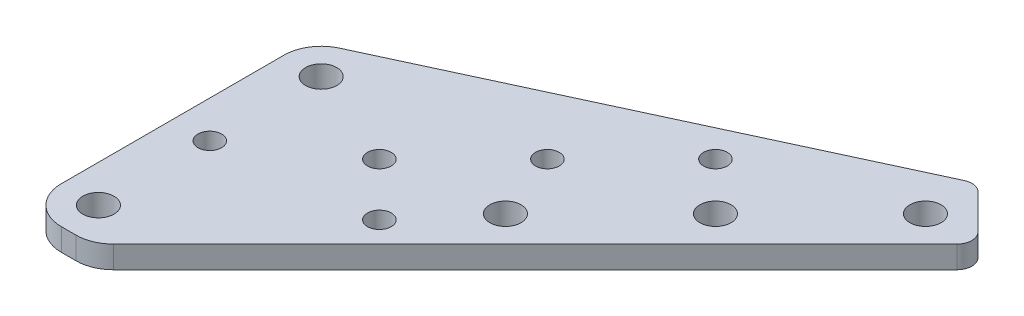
ISO-10303-21;
HEADER;
FILE_DESCRIPTION(('STEP AP214'),'2;1');
FILE_NAME('part.step','',(''),(''),'','','');
FILE_SCHEMA(('AUTOMOTIVE_DESIGN { 1 0 10303 214 1 1 1 1 }'));
ENDSEC;
DATA;
#1=APPLICATION_CONTEXT('core data for automotive mechanical design processes');
#2=APPLICATION_PROTOCOL_DEFINITION('international standard','automotive_design',2000,#1);
#3=PRODUCT_CONTEXT('',#1,'mechanical');
#4=PRODUCT('Part','Part','',(#3));
#5=PRODUCT_RELATED_PRODUCT_CATEGORY('part','',(#4));
#6=PRODUCT_DEFINITION_FORMATION('','',#4);
#7=PRODUCT_DEFINITION_CONTEXT('part definition',#1,'design');
#8=PRODUCT_DEFINITION('design','',#6,#7);
#9=PRODUCT_DEFINITION_SHAPE('','',#8);
#10=(LENGTH_UNIT() NAMED_UNIT(*) SI_UNIT(.MILLI.,.METRE.));
#11=(NAMED_UNIT(*) PLANE_ANGLE_UNIT() SI_UNIT($,.RADIAN.));
#12=(NAMED_UNIT(*) SI_UNIT($,.STERADIAN.) SOLID_ANGLE_UNIT());
#13=UNCERTAINTY_MEASURE_WITH_UNIT(LENGTH_MEASURE(1.E-05),#10,'distance_accuracy_value','');
#14=(GEOMETRIC_REPRESENTATION_CONTEXT(3) GLOBAL_UNCERTAINTY_ASSIGNED_CONTEXT((#13)) GLOBAL_UNIT_ASSIGNED_CONTEXT((#10,
#11,#12)) REPRESENTATION_CONTEXT('',''));
#15=CARTESIAN_POINT('',(0.,0.,0.));
#16=DIRECTION('',(0.,0.,1.));
#17=DIRECTION('',(1.,0.,0.));
#18=AXIS2_PLACEMENT_3D('',#15,#16,#17);
#19=CARTESIAN_POINT('',(-237.,3.,205.));
#20=DIRECTION('',(0.,1.,0.));
#21=DIRECTION('',(0.,0.,1.));
#22=AXIS2_PLACEMENT_3D('',#19,#20,#21);
#23=PLANE('',#22);
#24=CARTESIAN_POINT('',(-212.132034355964,3.,199.404112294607));
#25=DIRECTION('',(0.,1.,0.));
#26=DIRECTION('',(0.,0.,1.));
#27=AXIS2_PLACEMENT_3D('',#24,#25,#26);
#28=CIRCLE('',#27,1.59999999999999);
#29=CARTESIAN_POINT('',(-212.132034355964,3.,201.004112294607));
#30=VERTEX_POINT('',#29);
#31=EDGE_CURVE('E261',#30,#30,#28,.T.);
#32=ORIENTED_EDGE('',*,*,#31,.F.);
#33=EDGE_LOOP('',(#32));
#34=FACE_BOUND('',#33,.T.);
#35=CARTESIAN_POINT('',(-200.818325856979,3.,188.090403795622));
#36=DIRECTION('',(0.,1.,0.));
#37=DIRECTION('',(0.,0.,1.));
#38=AXIS2_PLACEMENT_3D('',#35,#36,#37);
#39=CIRCLE('',#38,1.59999999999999);
#40=CARTESIAN_POINT('',(-200.818325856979,3.,189.690403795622));
#41=VERTEX_POINT('',#40);
#42=EDGE_CURVE('E249',#41,#41,#39,.T.);
#43=ORIENTED_EDGE('',*,*,#42,.F.);
#44=EDGE_LOOP('',(#43));
#45=FACE_BOUND('',#44,.T.);
#46=CARTESIAN_POINT('',(-237.,3.,235.));
#47=DIRECTION('',(0.,1.,0.));
#48=DIRECTION('',(0.,0.,1.));
#49=AXIS2_PLACEMENT_3D('',#46,#47,#48);
#50=CIRCLE('',#49,2.09999999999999);
#51=CARTESIAN_POINT('',(-237.,3.,237.1));
#52=VERTEX_POINT('',#51);
#53=EDGE_CURVE('E237',#52,#52,#50,.T.);
#54=ORIENTED_EDGE('',*,*,#53,.F.);
#55=EDGE_LOOP('',(#54));
#56=FACE_BOUND('',#55,.T.);
#57=CARTESIAN_POINT('',(-180.312229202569,3.,180.31222920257));
#58=DIRECTION('',(0.,1.,0.));
#59=DIRECTION('',(0.,0.,1.));
#60=AXIS2_PLACEMENT_3D('',#57,#58,#59);
#61=CIRCLE('',#60,2.09999999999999);
#62=CARTESIAN_POINT('',(-180.312229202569,3.,182.41222920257));
#63=VERTEX_POINT('',#62);
#64=EDGE_CURVE('E225',#63,#63,#61,.T.);
#65=ORIENTED_EDGE('',*,*,#64,.F.);
#66=EDGE_LOOP('',(#65));
#67=FACE_BOUND('',#66,.T.);
#68=CARTESIAN_POINT('',(-208.596500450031,3.,208.596500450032));
#69=DIRECTION('',(0.,1.,0.));
#70=DIRECTION('',(0.,0.,1.));
#71=AXIS2_PLACEMENT_3D('',#68,#69,#70);
#72=CIRCLE('',#71,2.09999999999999);
#73=CARTESIAN_POINT('',(-208.596500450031,3.,210.696500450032));
#74=VERTEX_POINT('',#73);
#75=EDGE_CURVE('E157',#74,#74,#72,.T.);
#76=ORIENTED_EDGE('',*,*,#75,.F.);
#77=EDGE_LOOP('',(#76));
#78=FACE_BOUND('',#77,.T.);
#79=DIRECTION('',(1.,0.,0.));
#80=VECTOR('',#79,1.);
#81=CARTESIAN_POINT('',(-237.,3.,240.));
#82=LINE('',#81,#80);
#83=CARTESIAN_POINT('',(-237.,3.,240.));
#84=VERTEX_POINT('',#83);
#85=CARTESIAN_POINT('',(-234.999999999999,3.,240.));
#86=VERTEX_POINT('',#85);
#87=EDGE_CURVE('E151',#84,#86,#82,.T.);
#88=ORIENTED_EDGE('',*,*,#87,.T.);
#89=CARTESIAN_POINT('',(-234.999999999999,3.,235.));
#90=DIRECTION('',(0.,1.,0.));
#91=DIRECTION('',(0.,0.,1.));
#92=AXIS2_PLACEMENT_3D('',#89,#90,#91);
#93=CIRCLE('',#92,5.);
#94=CARTESIAN_POINT('',(-231.464466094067,3.,238.535533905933));
#95=VERTEX_POINT('',#94);
#96=EDGE_CURVE('E11',#86,#95,#93,.T.);
#97=ORIENTED_EDGE('',*,*,#96,.T.);
#98=DIRECTION('',(0.707106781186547,0.,-0.707106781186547));
#99=VECTOR('',#98,1.);
#100=CARTESIAN_POINT('',(-232.928932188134,3.,240.));
#101=LINE('',#100,#99);
#102=CARTESIAN_POINT('',(-174.655374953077,3.,181.726442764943));
#103=VERTEX_POINT('',#102);
#104=EDGE_CURVE('E169',#95,#103,#101,.T.);
#105=ORIENTED_EDGE('',*,*,#104,.T.);
#106=CARTESIAN_POINT('',(-176.06958851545,3.,180.31222920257));
#107=DIRECTION('',(0.,1.,0.));
#108=DIRECTION('',(0.,0.,1.));
#109=AXIS2_PLACEMENT_3D('',#106,#107,#108);
#110=CIRCLE('',#109,2.);
#111=CARTESIAN_POINT('',(-174.655374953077,3.,178.898015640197));
#112=VERTEX_POINT('',#111);
#113=EDGE_CURVE('E187',#103,#112,#110,.T.);
#114=ORIENTED_EDGE('',*,*,#113,.T.);
#115=DIRECTION('',(-0.707106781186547,0.,-0.707106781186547));
#116=VECTOR('',#115,1.);
#117=CARTESIAN_POINT('',(-173.241161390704,3.,180.31222920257));
#118=LINE('',#117,#116);
#119=CARTESIAN_POINT('',(-179.32481360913,3.,174.228576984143));
#120=VERTEX_POINT('',#119);
#121=EDGE_CURVE('E129',#112,#120,#118,.T.);
#122=ORIENTED_EDGE('',*,*,#121,.T.);
#123=CARTESIAN_POINT('',(-180.739027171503,3.,175.642790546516));
#124=DIRECTION('',(0.,1.,0.));
#125=DIRECTION('',(0.,0.,1.));
#126=AXIS2_PLACEMENT_3D('',#123,#124,#125);
#127=CIRCLE('',#126,2.);
#128=CARTESIAN_POINT('',(-181.579392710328,3.,173.827911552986));
#129=VERTEX_POINT('',#128);
#130=EDGE_CURVE('E125',#120,#129,#127,.T.);
#131=ORIENTED_EDGE('',*,*,#130,.T.);
#132=DIRECTION('',(-0.907439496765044,0.,0.420182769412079));
#133=VECTOR('',#132,1.);
#134=CARTESIAN_POINT('',(-180.312229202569,3.,173.241161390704));
#135=LINE('',#134,#133);
#136=CARTESIAN_POINT('',(-239.10091384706,3.,200.462802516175));
#137=VERTEX_POINT('',#136);
#138=EDGE_CURVE('E117',#129,#137,#135,.T.);
#139=ORIENTED_EDGE('',*,*,#138,.T.);
#140=CARTESIAN_POINT('',(-237.,3.,205.));
#141=DIRECTION('',(0.,1.,0.));
#142=DIRECTION('',(0.,0.,1.));
#143=AXIS2_PLACEMENT_3D('',#140,#141,#142);
#144=CIRCLE('',#143,5.00000000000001);
#145=CARTESIAN_POINT('',(-242.,3.,205.));
#146=VERTEX_POINT('',#145);
#147=EDGE_CURVE('E121',#137,#146,#144,.T.);
#148=ORIENTED_EDGE('',*,*,#147,.T.);
#149=DIRECTION('',(0.,0.,1.));
#150=VECTOR('',#149,1.);
#151=CARTESIAN_POINT('',(-242.,3.,205.));
#152=LINE('',#151,#150);
#153=CARTESIAN_POINT('',(-242.,3.,235.));
#154=VERTEX_POINT('',#153);
#155=EDGE_CURVE('E144',#146,#154,#152,.T.);
#156=ORIENTED_EDGE('',*,*,#155,.T.);
#157=CARTESIAN_POINT('',(-237.,3.,235.));
#158=DIRECTION('',(0.,1.,0.));
#159=DIRECTION('',(0.,0.,1.));
#160=AXIS2_PLACEMENT_3D('',#157,#158,#159);
#161=CIRCLE('',#160,5.);
#162=EDGE_CURVE('E146',#154,#84,#161,.T.);
#163=ORIENTED_EDGE('',*,*,#162,.T.);
#164=EDGE_LOOP('',(#88,#97,#105,#114,#122,#131,#139,#148,#156,#163));
#165=FACE_BOUND('',#164,.T.);
#166=CARTESIAN_POINT('',(-194.4543648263,3.,194.454364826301));
#167=DIRECTION('',(0.,1.,0.));
#168=DIRECTION('',(0.,0.,1.));
#169=AXIS2_PLACEMENT_3D('',#166,#167,#168);
#170=CIRCLE('',#169,2.09999999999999);
#171=CARTESIAN_POINT('',(-194.4543648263,3.,196.554364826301));
#172=VERTEX_POINT('',#171);
#173=EDGE_CURVE('E219',#172,#172,#170,.T.);
#174=ORIENTED_EDGE('',*,*,#173,.F.);
#175=EDGE_LOOP('',(#174));
#176=FACE_BOUND('',#175,.T.);
#177=CARTESIAN_POINT('',(-237.,3.,220.));
#178=DIRECTION('',(0.,1.,0.));
#179=DIRECTION('',(0.,0.,1.));
#180=AXIS2_PLACEMENT_3D('',#177,#178,#179);
#181=CIRCLE('',#180,1.59999999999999);
#182=CARTESIAN_POINT('',(-237.,3.,221.6));
#183=VERTEX_POINT('',#182);
#184=EDGE_CURVE('E231',#183,#183,#181,.T.);
#185=ORIENTED_EDGE('',*,*,#184,.F.);
#186=EDGE_LOOP('',(#185));
#187=FACE_BOUND('',#186,.T.);
#188=CARTESIAN_POINT('',(-237.,3.,205.));
#189=DIRECTION('',(0.,1.,0.));
#190=DIRECTION('',(0.,0.,1.));
#191=AXIS2_PLACEMENT_3D('',#188,#189,#190);
#192=CIRCLE('',#191,2.09999999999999);
#193=CARTESIAN_POINT('',(-237.,3.,207.1));
#194=VERTEX_POINT('',#193);
#195=EDGE_CURVE('E243',#194,#194,#192,.T.);
#196=ORIENTED_EDGE('',*,*,#195,.F.);
#197=EDGE_LOOP('',(#196));
#198=FACE_BOUND('',#197,.T.);
#199=CARTESIAN_POINT('',(-216.374675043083,3.,217.788888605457));
#200=DIRECTION('',(0.,1.,0.));
#201=DIRECTION('',(0.,0.,1.));
#202=AXIS2_PLACEMENT_3D('',#199,#200,#201);
#203=CIRCLE('',#202,1.59999999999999);
#204=CARTESIAN_POINT('',(-216.374675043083,3.,219.388888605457));
#205=VERTEX_POINT('',#204);
#206=EDGE_CURVE('E255',#205,#205,#203,.T.);
#207=ORIENTED_EDGE('',*,*,#206,.F.);
#208=EDGE_LOOP('',(#207));
#209=FACE_BOUND('',#208,.T.);
#210=CARTESIAN_POINT('',(-223.445742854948,3.,210.717820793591));
#211=DIRECTION('',(0.,1.,0.));
#212=DIRECTION('',(0.,0.,1.));
#213=AXIS2_PLACEMENT_3D('',#210,#211,#212);
#214=CIRCLE('',#213,1.59999999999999);
#215=CARTESIAN_POINT('',(-223.445742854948,3.,212.317820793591));
#216=VERTEX_POINT('',#215);
#217=EDGE_CURVE('E267',#216,#216,#214,.T.);
#218=ORIENTED_EDGE('',*,*,#217,.F.);
#219=EDGE_LOOP('',(#218));
#220=FACE_BOUND('',#219,.T.);
#221=ADVANCED_FACE('F41',(#34,#45,#56,#67,#78,#165,#176,#187,#198,#209,#220),#23,.T.);
#222=CARTESIAN_POINT('',(-237.,0.,205.));
#223=DIRECTION('',(0.,1.,0.));
#224=DIRECTION('',(0.,0.,1.));
#225=AXIS2_PLACEMENT_3D('',#222,#223,#224);
#226=PLANE('',#225);
#227=DIRECTION('',(0.707106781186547,0.,-0.707106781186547));
#228=VECTOR('',#227,1.);
#229=CARTESIAN_POINT('',(-232.928932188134,0.,240.));
#230=LINE('',#229,#228);
#231=CARTESIAN_POINT('',(-231.464466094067,0.,238.535533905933));
#232=VERTEX_POINT('',#231);
#233=CARTESIAN_POINT('',(-174.655374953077,0.,181.726442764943));
#234=VERTEX_POINT('',#233);
#235=EDGE_CURVE('E154',#232,#234,#230,.T.);
#236=ORIENTED_EDGE('',*,*,#235,.F.);
#237=CARTESIAN_POINT('',(-234.999999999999,0.,235.));
#238=DIRECTION('',(0.,1.,0.));
#239=DIRECTION('',(0.,0.,1.));
#240=AXIS2_PLACEMENT_3D('',#237,#238,#239);
#241=CIRCLE('',#240,5.);
#242=CARTESIAN_POINT('',(-234.999999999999,0.,240.));
#243=VERTEX_POINT('',#242);
#244=EDGE_CURVE('E63',#232,#243,#241,.F.);
#245=ORIENTED_EDGE('',*,*,#244,.T.);
#246=DIRECTION('',(1.,0.,0.));
#247=VECTOR('',#246,1.);
#248=CARTESIAN_POINT('',(-237.,0.,240.));
#249=LINE('',#248,#247);
#250=CARTESIAN_POINT('',(-237.,0.,240.));
#251=VERTEX_POINT('',#250);
#252=EDGE_CURVE('E167',#251,#243,#249,.T.);
#253=ORIENTED_EDGE('',*,*,#252,.F.);
#254=CARTESIAN_POINT('',(-237.,0.,235.));
#255=DIRECTION('',(0.,1.,0.));
#256=DIRECTION('',(0.,0.,1.));
#257=AXIS2_PLACEMENT_3D('',#254,#255,#256);
#258=CIRCLE('',#257,5.);
#259=CARTESIAN_POINT('',(-242.,0.,235.));
#260=VERTEX_POINT('',#259);
#261=EDGE_CURVE('E165',#260,#251,#258,.T.);
#262=ORIENTED_EDGE('',*,*,#261,.F.);
#263=DIRECTION('',(0.,0.,1.));
#264=VECTOR('',#263,1.);
#265=CARTESIAN_POINT('',(-242.,0.,205.));
#266=LINE('',#265,#264);
#267=CARTESIAN_POINT('',(-242.,0.,205.));
#268=VERTEX_POINT('',#267);
#269=EDGE_CURVE('E163',#268,#260,#266,.T.);
#270=ORIENTED_EDGE('',*,*,#269,.F.);
#271=CARTESIAN_POINT('',(-237.,0.,205.));
#272=DIRECTION('',(0.,1.,0.));
#273=DIRECTION('',(0.,0.,1.));
#274=AXIS2_PLACEMENT_3D('',#271,#272,#273);
#275=CIRCLE('',#274,5.00000000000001);
#276=CARTESIAN_POINT('',(-239.10091384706,0.,200.462802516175));
#277=VERTEX_POINT('',#276);
#278=EDGE_CURVE('E161',#277,#268,#275,.T.);
#279=ORIENTED_EDGE('',*,*,#278,.F.);
#280=DIRECTION('',(-0.907439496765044,0.,0.420182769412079));
#281=VECTOR('',#280,1.);
#282=CARTESIAN_POINT('',(-180.312229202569,0.,173.241161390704));
#283=LINE('',#282,#281);
#284=CARTESIAN_POINT('',(-181.579392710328,0.,173.827911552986));
#285=VERTEX_POINT('',#284);
#286=EDGE_CURVE('E135',#285,#277,#283,.T.);
#287=ORIENTED_EDGE('',*,*,#286,.F.);
#288=CARTESIAN_POINT('',(-180.739027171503,0.,175.642790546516));
#289=DIRECTION('',(0.,1.,0.));
#290=DIRECTION('',(0.,0.,1.));
#291=AXIS2_PLACEMENT_3D('',#288,#289,#290);
#292=CIRCLE('',#291,2.);
#293=CARTESIAN_POINT('',(-179.32481360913,0.,174.228576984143));
#294=VERTEX_POINT('',#293);
#295=EDGE_CURVE('E180',#285,#294,#292,.F.);
#296=ORIENTED_EDGE('',*,*,#295,.T.);
#297=DIRECTION('',(-0.707106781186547,0.,-0.707106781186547));
#298=VECTOR('',#297,1.);
#299=CARTESIAN_POINT('',(-173.241161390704,0.,180.31222920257));
#300=LINE('',#299,#298);
#301=CARTESIAN_POINT('',(-174.655374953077,0.,178.898015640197));
#302=VERTEX_POINT('',#301);
#303=EDGE_CURVE('E156',#302,#294,#300,.T.);
#304=ORIENTED_EDGE('',*,*,#303,.F.);
#305=CARTESIAN_POINT('',(-176.06958851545,0.,180.31222920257));
#306=DIRECTION('',(0.,1.,0.));
#307=DIRECTION('',(0.,0.,1.));
#308=AXIS2_PLACEMENT_3D('',#305,#306,#307);
#309=CIRCLE('',#308,2.);
#310=EDGE_CURVE('E177',#302,#234,#309,.F.);
#311=ORIENTED_EDGE('',*,*,#310,.T.);
#312=EDGE_LOOP('',(#236,#245,#253,#262,#270,#279,#287,#296,#304,#311));
#313=FACE_BOUND('',#312,.T.);
#314=CARTESIAN_POINT('',(-208.596500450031,0.,208.596500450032));
#315=DIRECTION('',(0.,1.,0.));
#316=DIRECTION('',(0.,0.,1.));
#317=AXIS2_PLACEMENT_3D('',#314,#315,#316);
#318=CIRCLE('',#317,2.09999999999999);
#319=CARTESIAN_POINT('',(-208.596500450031,0.,210.696500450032));
#320=VERTEX_POINT('',#319);
#321=EDGE_CURVE('E216',#320,#320,#318,.T.);
#322=ORIENTED_EDGE('',*,*,#321,.T.);
#323=EDGE_LOOP('',(#322));
#324=FACE_BOUND('',#323,.T.);
#325=CARTESIAN_POINT('',(-194.4543648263,0.,194.454364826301));
#326=DIRECTION('',(0.,1.,0.));
#327=DIRECTION('',(0.,0.,1.));
#328=AXIS2_PLACEMENT_3D('',#325,#326,#327);
#329=CIRCLE('',#328,2.09999999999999);
#330=CARTESIAN_POINT('',(-194.4543648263,0.,196.554364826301));
#331=VERTEX_POINT('',#330);
#332=EDGE_CURVE('E222',#331,#331,#329,.T.);
#333=ORIENTED_EDGE('',*,*,#332,.T.);
#334=EDGE_LOOP('',(#333));
#335=FACE_BOUND('',#334,.T.);
#336=CARTESIAN_POINT('',(-180.312229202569,0.,180.31222920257));
#337=DIRECTION('',(0.,1.,0.));
#338=DIRECTION('',(0.,0.,1.));
#339=AXIS2_PLACEMENT_3D('',#336,#337,#338);
#340=CIRCLE('',#339,2.09999999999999);
#341=CARTESIAN_POINT('',(-180.312229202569,0.,182.41222920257));
#342=VERTEX_POINT('',#341);
#343=EDGE_CURVE('E228',#342,#342,#340,.T.);
#344=ORIENTED_EDGE('',*,*,#343,.T.);
#345=EDGE_LOOP('',(#344));
#346=FACE_BOUND('',#345,.T.);
#347=CARTESIAN_POINT('',(-237.,0.,220.));
#348=DIRECTION('',(0.,1.,0.));
#349=DIRECTION('',(0.,0.,1.));
#350=AXIS2_PLACEMENT_3D('',#347,#348,#349);
#351=CIRCLE('',#350,1.59999999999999);
#352=CARTESIAN_POINT('',(-237.,0.,221.6));
#353=VERTEX_POINT('',#352);
#354=EDGE_CURVE('E234',#353,#353,#351,.T.);
#355=ORIENTED_EDGE('',*,*,#354,.T.);
#356=EDGE_LOOP('',(#355));
#357=FACE_BOUND('',#356,.T.);
#358=CARTESIAN_POINT('',(-237.,0.,235.));
#359=DIRECTION('',(0.,1.,0.));
#360=DIRECTION('',(0.,0.,1.));
#361=AXIS2_PLACEMENT_3D('',#358,#359,#360);
#362=CIRCLE('',#361,2.09999999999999);
#363=CARTESIAN_POINT('',(-237.,0.,237.1));
#364=VERTEX_POINT('',#363);
#365=EDGE_CURVE('E240',#364,#364,#362,.T.);
#366=ORIENTED_EDGE('',*,*,#365,.T.);
#367=EDGE_LOOP('',(#366));
#368=FACE_BOUND('',#367,.T.);
#369=CARTESIAN_POINT('',(-237.,0.,205.));
#370=DIRECTION('',(0.,1.,0.));
#371=DIRECTION('',(0.,0.,1.));
#372=AXIS2_PLACEMENT_3D('',#369,#370,#371);
#373=CIRCLE('',#372,2.09999999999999);
#374=CARTESIAN_POINT('',(-237.,0.,207.1));
#375=VERTEX_POINT('',#374);
#376=EDGE_CURVE('E246',#375,#375,#373,.T.);
#377=ORIENTED_EDGE('',*,*,#376,.T.);
#378=EDGE_LOOP('',(#377));
#379=FACE_BOUND('',#378,.T.);
#380=CARTESIAN_POINT('',(-200.818325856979,0.,188.090403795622));
#381=DIRECTION('',(0.,1.,0.));
#382=DIRECTION('',(0.,0.,1.));
#383=AXIS2_PLACEMENT_3D('',#380,#381,#382);
#384=CIRCLE('',#383,1.59999999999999);
#385=CARTESIAN_POINT('',(-200.818325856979,0.,189.690403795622));
#386=VERTEX_POINT('',#385);
#387=EDGE_CURVE('E252',#386,#386,#384,.T.);
#388=ORIENTED_EDGE('',*,*,#387,.T.);
#389=EDGE_LOOP('',(#388));
#390=FACE_BOUND('',#389,.T.);
#391=CARTESIAN_POINT('',(-216.374675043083,0.,217.788888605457));
#392=DIRECTION('',(0.,1.,0.));
#393=DIRECTION('',(0.,0.,1.));
#394=AXIS2_PLACEMENT_3D('',#391,#392,#393);
#395=CIRCLE('',#394,1.59999999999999);
#396=CARTESIAN_POINT('',(-216.374675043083,0.,219.388888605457));
#397=VERTEX_POINT('',#396);
#398=EDGE_CURVE('E258',#397,#397,#395,.T.);
#399=ORIENTED_EDGE('',*,*,#398,.T.);
#400=EDGE_LOOP('',(#399));
#401=FACE_BOUND('',#400,.T.);
#402=CARTESIAN_POINT('',(-212.132034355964,0.,199.404112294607));
#403=DIRECTION('',(0.,1.,0.));
#404=DIRECTION('',(0.,0.,1.));
#405=AXIS2_PLACEMENT_3D('',#402,#403,#404);
#406=CIRCLE('',#405,1.59999999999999);
#407=CARTESIAN_POINT('',(-212.132034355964,0.,201.004112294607));
#408=VERTEX_POINT('',#407);
#409=EDGE_CURVE('E264',#408,#408,#406,.T.);
#410=ORIENTED_EDGE('',*,*,#409,.T.);
#411=EDGE_LOOP('',(#410));
#412=FACE_BOUND('',#411,.T.);
#413=CARTESIAN_POINT('',(-223.445742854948,0.,210.717820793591));
#414=DIRECTION('',(0.,1.,0.));
#415=DIRECTION('',(0.,0.,1.));
#416=AXIS2_PLACEMENT_3D('',#413,#414,#415);
#417=CIRCLE('',#416,1.59999999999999);
#418=CARTESIAN_POINT('',(-223.445742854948,0.,212.317820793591));
#419=VERTEX_POINT('',#418);
#420=EDGE_CURVE('E270',#419,#419,#417,.T.);
#421=ORIENTED_EDGE('',*,*,#420,.T.);
#422=EDGE_LOOP('',(#421));
#423=FACE_BOUND('',#422,.T.);
#424=ADVANCED_FACE('F202',(#313,#324,#335,#346,#357,#368,#379,#390,#401,#412,#423),#226,.F.);
#425=CARTESIAN_POINT('',(-232.928932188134,3.,240.));
#426=DIRECTION('',(-0.707106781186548,0.,-0.707106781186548));
#427=DIRECTION('',(-0.707106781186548,0.,0.707106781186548));
#428=AXIS2_PLACEMENT_3D('',#425,#426,#427);
#429=PLANE('',#428);
#430=ORIENTED_EDGE('',*,*,#104,.F.);
#431=DIRECTION('',(0.,-1.,0.));
#432=VECTOR('',#431,1.);
#433=CARTESIAN_POINT('',(-231.464466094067,3.,238.535533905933));
#434=LINE('',#433,#432);
#435=EDGE_CURVE('E193',#95,#232,#434,.T.);
#436=ORIENTED_EDGE('',*,*,#435,.T.);
#437=ORIENTED_EDGE('',*,*,#235,.T.);
#438=DIRECTION('',(0.,-1.,0.));
#439=VECTOR('',#438,1.);
#440=CARTESIAN_POINT('',(-174.655374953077,3.,181.726442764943));
#441=LINE('',#440,#439);
#442=EDGE_CURVE('E190',#234,#103,#441,.F.);
#443=ORIENTED_EDGE('',*,*,#442,.T.);
#444=EDGE_LOOP('',(#430,#436,#437,#443));
#445=FACE_BOUND('',#444,.T.);
#446=ADVANCED_FACE('F199',(#445),#429,.F.);
#447=CARTESIAN_POINT('',(-173.241161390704,3.,180.31222920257));
#448=DIRECTION('',(-0.707106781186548,0.,0.707106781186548));
#449=DIRECTION('',(0.707106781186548,0.,0.707106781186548));
#450=AXIS2_PLACEMENT_3D('',#447,#448,#449);
#451=PLANE('',#450);
#452=ORIENTED_EDGE('',*,*,#303,.T.);
#453=DIRECTION('',(0.,-1.,0.));
#454=VECTOR('',#453,1.);
#455=CARTESIAN_POINT('',(-179.32481360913,3.,174.228576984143));
#456=LINE('',#455,#454);
#457=EDGE_CURVE('E185',#294,#120,#456,.F.);
#458=ORIENTED_EDGE('',*,*,#457,.T.);
#459=ORIENTED_EDGE('',*,*,#121,.F.);
#460=DIRECTION('',(0.,-1.,0.));
#461=VECTOR('',#460,1.);
#462=CARTESIAN_POINT('',(-174.655374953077,3.,178.898015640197));
#463=LINE('',#462,#461);
#464=EDGE_CURVE('E182',#112,#302,#463,.T.);
#465=ORIENTED_EDGE('',*,*,#464,.T.);
#466=EDGE_LOOP('',(#452,#458,#459,#465));
#467=FACE_BOUND('',#466,.T.);
#468=ADVANCED_FACE('F212',(#467),#451,.F.);
#469=CARTESIAN_POINT('',(-180.312229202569,3.,173.241161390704));
#470=DIRECTION('',(0.420182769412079,0.,0.907439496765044));
#471=DIRECTION('',(0.907439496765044,0.,-0.420182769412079));
#472=AXIS2_PLACEMENT_3D('',#469,#470,#471);
#473=PLANE('',#472);
#474=ORIENTED_EDGE('',*,*,#138,.F.);
#475=DIRECTION('',(0.,-1.,0.));
#476=VECTOR('',#475,1.);
#477=CARTESIAN_POINT('',(-181.579392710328,3.,173.827911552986));
#478=LINE('',#477,#476);
#479=EDGE_CURVE('E138',#129,#285,#478,.T.);
#480=ORIENTED_EDGE('',*,*,#479,.T.);
#481=ORIENTED_EDGE('',*,*,#286,.T.);
#482=DIRECTION('',(0.,-1.,0.));
#483=VECTOR('',#482,1.);
#484=CARTESIAN_POINT('',(-239.10091384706,3.,200.462802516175));
#485=LINE('',#484,#483);
#486=EDGE_CURVE('E132',#137,#277,#485,.T.);
#487=ORIENTED_EDGE('',*,*,#486,.F.);
#488=EDGE_LOOP('',(#474,#480,#481,#487));
#489=FACE_BOUND('',#488,.T.);
#490=ADVANCED_FACE('F133',(#489),#473,.F.);
#491=CARTESIAN_POINT('',(-237.,3.,205.));
#492=DIRECTION('',(0.,-1.,0.));
#493=DIRECTION('',(0.,0.,-1.));
#494=AXIS2_PLACEMENT_3D('',#491,#492,#493);
#495=CYLINDRICAL_SURFACE('',#494,5.00000000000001);
#496=ORIENTED_EDGE('',*,*,#278,.T.);
#497=DIRECTION('',(0.,-1.,0.));
#498=VECTOR('',#497,1.);
#499=CARTESIAN_POINT('',(-242.,3.,205.));
#500=LINE('',#499,#498);
#501=EDGE_CURVE('E139',#146,#268,#500,.T.);
#502=ORIENTED_EDGE('',*,*,#501,.F.);
#503=ORIENTED_EDGE('',*,*,#147,.F.);
#504=ORIENTED_EDGE('',*,*,#486,.T.);
#505=EDGE_LOOP('',(#496,#502,#503,#504));
#506=FACE_BOUND('',#505,.T.);
#507=ADVANCED_FACE('F141',(#506),#495,.T.);
#508=CARTESIAN_POINT('',(-242.,3.,205.));
#509=DIRECTION('',(1.,0.,0.));
#510=DIRECTION('',(0.,0.,-1.));
#511=AXIS2_PLACEMENT_3D('',#508,#509,#510);
#512=PLANE('',#511);
#513=ORIENTED_EDGE('',*,*,#269,.T.);
#514=DIRECTION('',(0.,-1.,0.));
#515=VECTOR('',#514,1.);
#516=CARTESIAN_POINT('',(-242.,3.,235.));
#517=LINE('',#516,#515);
#518=EDGE_CURVE('E172',#154,#260,#517,.T.);
#519=ORIENTED_EDGE('',*,*,#518,.F.);
#520=ORIENTED_EDGE('',*,*,#155,.F.);
#521=ORIENTED_EDGE('',*,*,#501,.T.);
#522=EDGE_LOOP('',(#513,#519,#520,#521));
#523=FACE_BOUND('',#522,.T.);
#524=ADVANCED_FACE('F299',(#523),#512,.F.);
#525=CARTESIAN_POINT('',(-237.,3.,235.));
#526=DIRECTION('',(0.,-1.,0.));
#527=DIRECTION('',(0.,0.,-1.));
#528=AXIS2_PLACEMENT_3D('',#525,#526,#527);
#529=CYLINDRICAL_SURFACE('',#528,5.);
#530=ORIENTED_EDGE('',*,*,#261,.T.);
#531=DIRECTION('',(0.,-1.,0.));
#532=VECTOR('',#531,1.);
#533=CARTESIAN_POINT('',(-237.,3.,240.));
#534=LINE('',#533,#532);
#535=EDGE_CURVE('E153',#84,#251,#534,.T.);
#536=ORIENTED_EDGE('',*,*,#535,.F.);
#537=ORIENTED_EDGE('',*,*,#162,.F.);
#538=ORIENTED_EDGE('',*,*,#518,.T.);
#539=EDGE_LOOP('',(#530,#536,#537,#538));
#540=FACE_BOUND('',#539,.T.);
#541=ADVANCED_FACE('F296',(#540),#529,.T.);
#542=CARTESIAN_POINT('',(-237.,3.,240.));
#543=DIRECTION('',(0.,0.,-1.));
#544=DIRECTION('',(-1.,0.,0.));
#545=AXIS2_PLACEMENT_3D('',#542,#543,#544);
#546=PLANE('',#545);
#547=ORIENTED_EDGE('',*,*,#252,.T.);
#548=DIRECTION('',(0.,-1.,0.));
#549=VECTOR('',#548,1.);
#550=CARTESIAN_POINT('',(-234.999999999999,3.,240.));
#551=LINE('',#550,#549);
#552=EDGE_CURVE('E49',#243,#86,#551,.F.);
#553=ORIENTED_EDGE('',*,*,#552,.T.);
#554=ORIENTED_EDGE('',*,*,#87,.F.);
#555=ORIENTED_EDGE('',*,*,#535,.T.);
#556=EDGE_LOOP('',(#547,#553,#554,#555));
#557=FACE_BOUND('',#556,.T.);
#558=ADVANCED_FACE('F293',(#557),#546,.F.);
#559=CARTESIAN_POINT('',(-208.596500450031,3.,208.596500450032));
#560=DIRECTION('',(0.,-1.,0.));
#561=DIRECTION('',(0.,0.,-1.));
#562=AXIS2_PLACEMENT_3D('',#559,#560,#561);
#563=CYLINDRICAL_SURFACE('',#562,2.09999999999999);
#564=ORIENTED_EDGE('',*,*,#75,.T.);
#565=EDGE_LOOP('',(#564));
#566=FACE_BOUND('',#565,.T.);
#567=ORIENTED_EDGE('',*,*,#321,.F.);
#568=EDGE_LOOP('',(#567));
#569=FACE_BOUND('',#568,.T.);
#570=ADVANCED_FACE('F290',(#566,#569),#563,.F.);
#571=CARTESIAN_POINT('',(-194.4543648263,3.,194.454364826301));
#572=DIRECTION('',(0.,-1.,0.));
#573=DIRECTION('',(0.,0.,-1.));
#574=AXIS2_PLACEMENT_3D('',#571,#572,#573);
#575=CYLINDRICAL_SURFACE('',#574,2.09999999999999);
#576=ORIENTED_EDGE('',*,*,#173,.T.);
#577=EDGE_LOOP('',(#576));
#578=FACE_BOUND('',#577,.T.);
#579=ORIENTED_EDGE('',*,*,#332,.F.);
#580=EDGE_LOOP('',(#579));
#581=FACE_BOUND('',#580,.T.);
#582=ADVANCED_FACE('F380',(#578,#581),#575,.F.);
#583=CARTESIAN_POINT('',(-180.312229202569,3.,180.31222920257));
#584=DIRECTION('',(0.,-1.,0.));
#585=DIRECTION('',(0.,0.,-1.));
#586=AXIS2_PLACEMENT_3D('',#583,#584,#585);
#587=CYLINDRICAL_SURFACE('',#586,2.09999999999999);
#588=ORIENTED_EDGE('',*,*,#64,.T.);
#589=EDGE_LOOP('',(#588));
#590=FACE_BOUND('',#589,.T.);
#591=ORIENTED_EDGE('',*,*,#343,.F.);
#592=EDGE_LOOP('',(#591));
#593=FACE_BOUND('',#592,.T.);
#594=ADVANCED_FACE('F388',(#590,#593),#587,.F.);
#595=CARTESIAN_POINT('',(-237.,3.,220.));
#596=DIRECTION('',(0.,-1.,0.));
#597=DIRECTION('',(0.,0.,-1.));
#598=AXIS2_PLACEMENT_3D('',#595,#596,#597);
#599=CYLINDRICAL_SURFACE('',#598,1.59999999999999);
#600=ORIENTED_EDGE('',*,*,#184,.T.);
#601=EDGE_LOOP('',(#600));
#602=FACE_BOUND('',#601,.T.);
#603=ORIENTED_EDGE('',*,*,#354,.F.);
#604=EDGE_LOOP('',(#603));
#605=FACE_BOUND('',#604,.T.);
#606=ADVANCED_FACE('F396',(#602,#605),#599,.F.);
#607=CARTESIAN_POINT('',(-237.,3.,235.));
#608=DIRECTION('',(0.,-1.,0.));
#609=DIRECTION('',(0.,0.,-1.));
#610=AXIS2_PLACEMENT_3D('',#607,#608,#609);
#611=CYLINDRICAL_SURFACE('',#610,2.09999999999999);
#612=ORIENTED_EDGE('',*,*,#53,.T.);
#613=EDGE_LOOP('',(#612));
#614=FACE_BOUND('',#613,.T.);
#615=ORIENTED_EDGE('',*,*,#365,.F.);
#616=EDGE_LOOP('',(#615));
#617=FACE_BOUND('',#616,.T.);
#618=ADVANCED_FACE('F405',(#614,#617),#611,.F.);
#619=CARTESIAN_POINT('',(-237.,3.,205.));
#620=DIRECTION('',(0.,-1.,0.));
#621=DIRECTION('',(0.,0.,-1.));
#622=AXIS2_PLACEMENT_3D('',#619,#620,#621);
#623=CYLINDRICAL_SURFACE('',#622,2.09999999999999);
#624=ORIENTED_EDGE('',*,*,#195,.T.);
#625=EDGE_LOOP('',(#624));
#626=FACE_BOUND('',#625,.T.);
#627=ORIENTED_EDGE('',*,*,#376,.F.);
#628=EDGE_LOOP('',(#627));
#629=FACE_BOUND('',#628,.T.);
#630=ADVANCED_FACE('F414',(#626,#629),#623,.F.);
#631=CARTESIAN_POINT('',(-200.818325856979,3.,188.090403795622));
#632=DIRECTION('',(0.,-1.,0.));
#633=DIRECTION('',(0.,0.,-1.));
#634=AXIS2_PLACEMENT_3D('',#631,#632,#633);
#635=CYLINDRICAL_SURFACE('',#634,1.59999999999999);
#636=ORIENTED_EDGE('',*,*,#42,.T.);
#637=EDGE_LOOP('',(#636));
#638=FACE_BOUND('',#637,.T.);
#639=ORIENTED_EDGE('',*,*,#387,.F.);
#640=EDGE_LOOP('',(#639));
#641=FACE_BOUND('',#640,.T.);
#642=ADVANCED_FACE('F423',(#638,#641),#635,.F.);
#643=CARTESIAN_POINT('',(-216.374675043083,3.,217.788888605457));
#644=DIRECTION('',(0.,-1.,0.));
#645=DIRECTION('',(0.,0.,-1.));
#646=AXIS2_PLACEMENT_3D('',#643,#644,#645);
#647=CYLINDRICAL_SURFACE('',#646,1.59999999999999);
#648=ORIENTED_EDGE('',*,*,#206,.T.);
#649=EDGE_LOOP('',(#648));
#650=FACE_BOUND('',#649,.T.);
#651=ORIENTED_EDGE('',*,*,#398,.F.);
#652=EDGE_LOOP('',(#651));
#653=FACE_BOUND('',#652,.T.);
#654=ADVANCED_FACE('F432',(#650,#653),#647,.F.);
#655=CARTESIAN_POINT('',(-212.132034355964,3.,199.404112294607));
#656=DIRECTION('',(0.,-1.,0.));
#657=DIRECTION('',(0.,0.,-1.));
#658=AXIS2_PLACEMENT_3D('',#655,#656,#657);
#659=CYLINDRICAL_SURFACE('',#658,1.59999999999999);
#660=ORIENTED_EDGE('',*,*,#31,.T.);
#661=EDGE_LOOP('',(#660));
#662=FACE_BOUND('',#661,.T.);
#663=ORIENTED_EDGE('',*,*,#409,.F.);
#664=EDGE_LOOP('',(#663));
#665=FACE_BOUND('',#664,.T.);
#666=ADVANCED_FACE('F441',(#662,#665),#659,.F.);
#667=CARTESIAN_POINT('',(-223.445742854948,3.,210.717820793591));
#668=DIRECTION('',(0.,-1.,0.));
#669=DIRECTION('',(0.,0.,-1.));
#670=AXIS2_PLACEMENT_3D('',#667,#668,#669);
#671=CYLINDRICAL_SURFACE('',#670,1.59999999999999);
#672=ORIENTED_EDGE('',*,*,#217,.T.);
#673=EDGE_LOOP('',(#672));
#674=FACE_BOUND('',#673,.T.);
#675=ORIENTED_EDGE('',*,*,#420,.F.);
#676=EDGE_LOOP('',(#675));
#677=FACE_BOUND('',#676,.T.);
#678=ADVANCED_FACE('F276',(#674,#677),#671,.F.);
#679=CARTESIAN_POINT('',(-180.739027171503,3.,175.642790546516));
#680=DIRECTION('',(0.,-1.,0.));
#681=DIRECTION('',(0.,0.,-1.));
#682=AXIS2_PLACEMENT_3D('',#679,#680,#681);
#683=CYLINDRICAL_SURFACE('',#682,2.);
#684=ORIENTED_EDGE('',*,*,#130,.F.);
#685=ORIENTED_EDGE('',*,*,#457,.F.);
#686=ORIENTED_EDGE('',*,*,#295,.F.);
#687=ORIENTED_EDGE('',*,*,#479,.F.);
#688=EDGE_LOOP('',(#684,#685,#686,#687));
#689=FACE_BOUND('',#688,.T.);
#690=ADVANCED_FACE('F312',(#689),#683,.T.);
#691=CARTESIAN_POINT('',(-176.06958851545,3.,180.31222920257));
#692=DIRECTION('',(0.,-1.,0.));
#693=DIRECTION('',(0.,0.,-1.));
#694=AXIS2_PLACEMENT_3D('',#691,#692,#693);
#695=CYLINDRICAL_SURFACE('',#694,2.);
#696=ORIENTED_EDGE('',*,*,#113,.F.);
#697=ORIENTED_EDGE('',*,*,#442,.F.);
#698=ORIENTED_EDGE('',*,*,#310,.F.);
#699=ORIENTED_EDGE('',*,*,#464,.F.);
#700=EDGE_LOOP('',(#696,#697,#698,#699));
#701=FACE_BOUND('',#700,.T.);
#702=ADVANCED_FACE('F209',(#701),#695,.T.);
#703=CARTESIAN_POINT('',(-234.999999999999,3.,235.));
#704=DIRECTION('',(0.,-1.,0.));
#705=DIRECTION('',(0.,0.,-1.));
#706=AXIS2_PLACEMENT_3D('',#703,#704,#705);
#707=CYLINDRICAL_SURFACE('',#706,5.);
#708=ORIENTED_EDGE('',*,*,#96,.F.);
#709=ORIENTED_EDGE('',*,*,#552,.F.);
#710=ORIENTED_EDGE('',*,*,#244,.F.);
#711=ORIENTED_EDGE('',*,*,#435,.F.);
#712=EDGE_LOOP('',(#708,#709,#710,#711));
#713=FACE_BOUND('',#712,.T.);
#714=ADVANCED_FACE('F43',(#713),#707,.T.);
#715=CLOSED_SHELL('',(#221,#424,#446,#468,#490,#507,#524,#541,#558,#570,#582,#594,#606,#618,
#630,#642,#654,#666,#678,#690,#702,#714));
#716=MANIFOLD_SOLID_BREP('B2',#715);
#717=ADVANCED_BREP_SHAPE_REPRESENTATION('',(#18,#716),#14);
#718=SHAPE_DEFINITION_REPRESENTATION(#9,#717);
ENDSEC;
END-ISO-10303-21;
